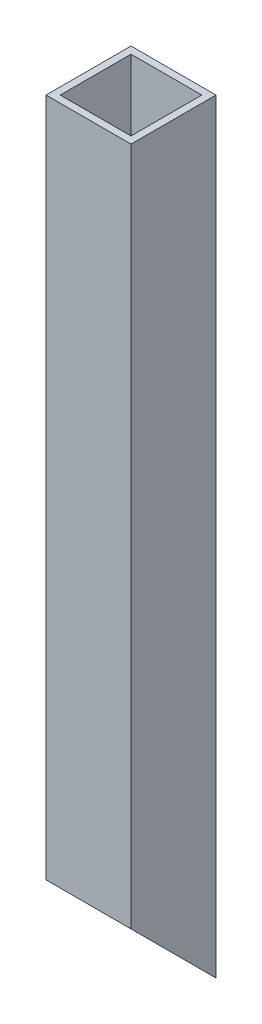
from build123d import *

# Parameters (mm, degrees)
SKETCH1_W           = 38.1
SKETCH1_H           = 38.1
SKETCH1_W_2         = 31.75
SKETCH1_H_2         = 31.75
BOSS_EXTRUDE1_DEPTH = 304.8
BOSS_EXTRUDE2_DEPTH = 38.1
SKETCH6_W           = 31.75
SKETCH6_H           = 31.75
CUT_EXTRUDE1_DEPTH  = 306.9883086


with BuildPart() as part:
    # Sketch1 → Boss-Extrude1 (new body)
    with BuildSketch(Plane(origin=(0, 0, 0), x_dir=(1, 0, 0), z_dir=(0, 1, 0))):
        Rectangle(SKETCH1_W, SKETCH1_H)
        Rectangle(SKETCH1_W_2, SKETCH1_H_2, mode=Mode.SUBTRACT)
    extrude(amount=BOSS_EXTRUDE1_DEPTH)

    # Sketch5 → Boss-Extrude2 (add)
    with BuildSketch(Plane(origin=(19.05, 0, 0), x_dir=(0, 0, -1), z_dir=(1, 0, 0))):
        Polygon((19.05, 0), (19.05, -38.1), (-19.05, 0), align=None)
    extrude(amount=-BOSS_EXTRUDE2_DEPTH)

    # Sketch6 → Cut-Extrude1 (cut, through all)
    with BuildSketch(Plane(origin=(0, 0, 0), x_dir=(1, 0, 0), z_dir=(0, 1, 0))):
        Rectangle(SKETCH6_W, SKETCH6_H)
    extrude(amount=-CUT_EXTRUDE1_DEPTH, mode=Mode.SUBTRACT)


solid = part.part
